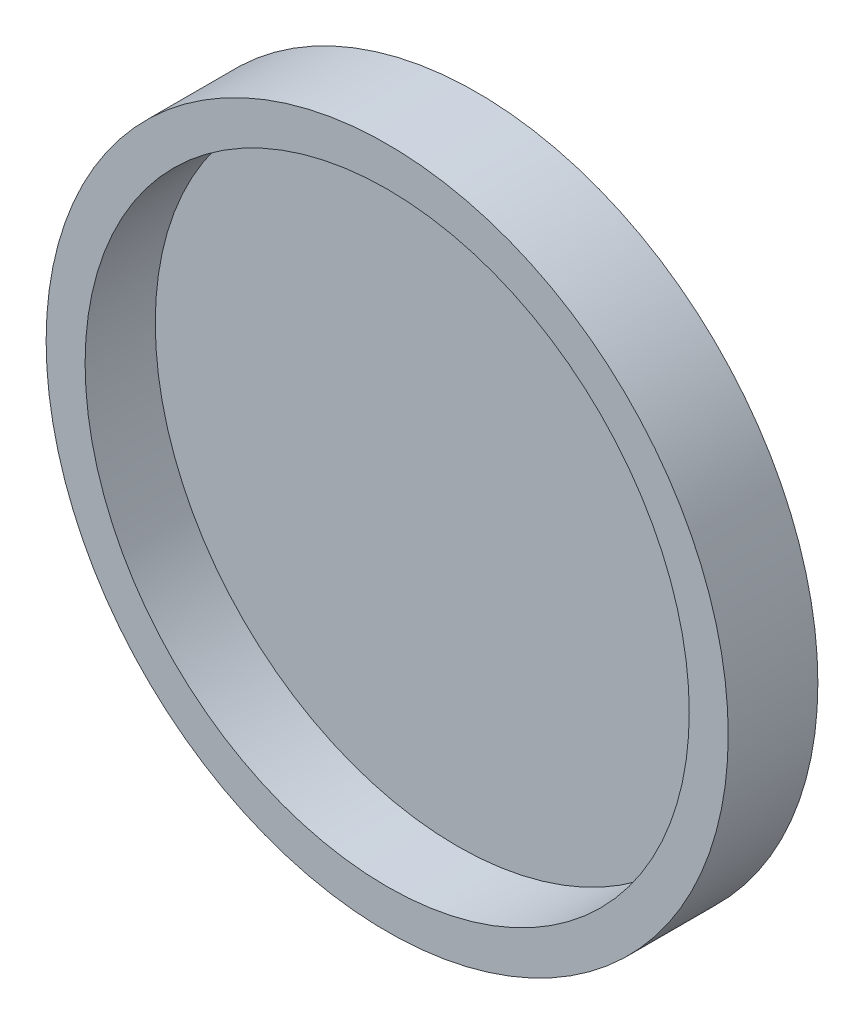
from build123d import *

# Parameters (mm, degrees)
SKETCH1_R           = 17.5
BOSS_EXTRUDE1_DEPTH = 4.6
SKETCH2_R           = 15.5
CUT_EXTRUDE1_DEPTH  = 3.6


with BuildPart() as part:
    # Sketch1 → Boss-Extrude1 (new body)
    with BuildSketch(Plane.XY):
        Circle(SKETCH1_R)
    extrude(amount=BOSS_EXTRUDE1_DEPTH)

    # Sketch2 → Cut-Extrude1 (cut)
    with BuildSketch(Plane.XY.offset(4.6)):
        Circle(SKETCH2_R)
    extrude(amount=-CUT_EXTRUDE1_DEPTH, mode=Mode.SUBTRACT)


solid = part.part
